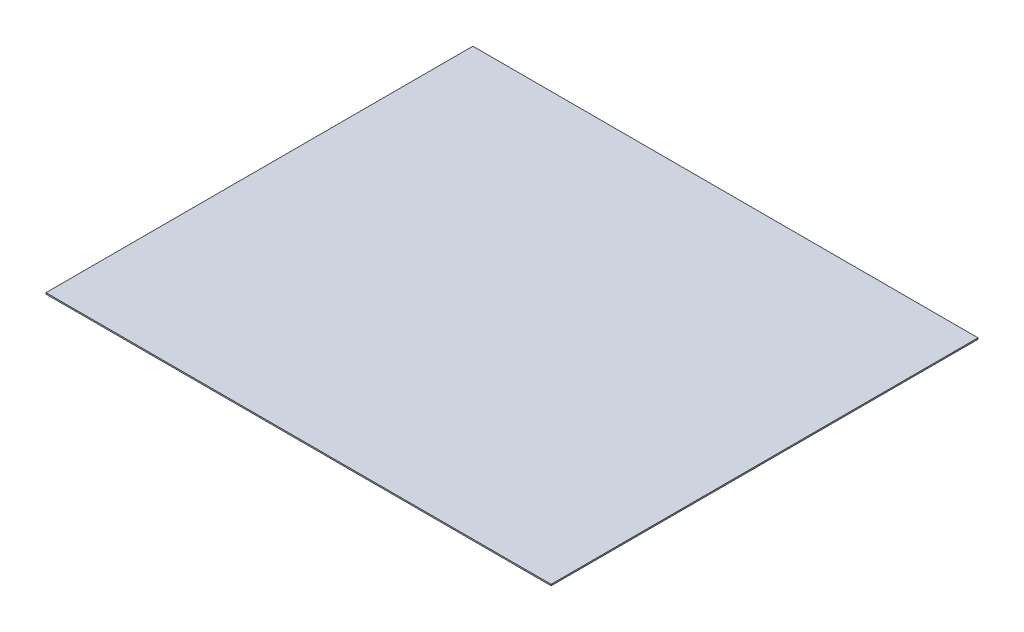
from build123d import *

# Parameters (mm, degrees)
SKETCH1_W           = 1803.4
SKETCH1_H           = 1524
BOSS_EXTRUDE1_DEPTH = 4.7625


with BuildPart() as part:
    # Sketch1 → Boss-Extrude1 (new body)
    with BuildSketch(Plane(origin=(0, 0, 0), x_dir=(1, 0, 0), z_dir=(0, 1, 0))):
        Rectangle(SKETCH1_W, SKETCH1_H)
    extrude(amount=BOSS_EXTRUDE1_DEPTH)


solid = part.part
